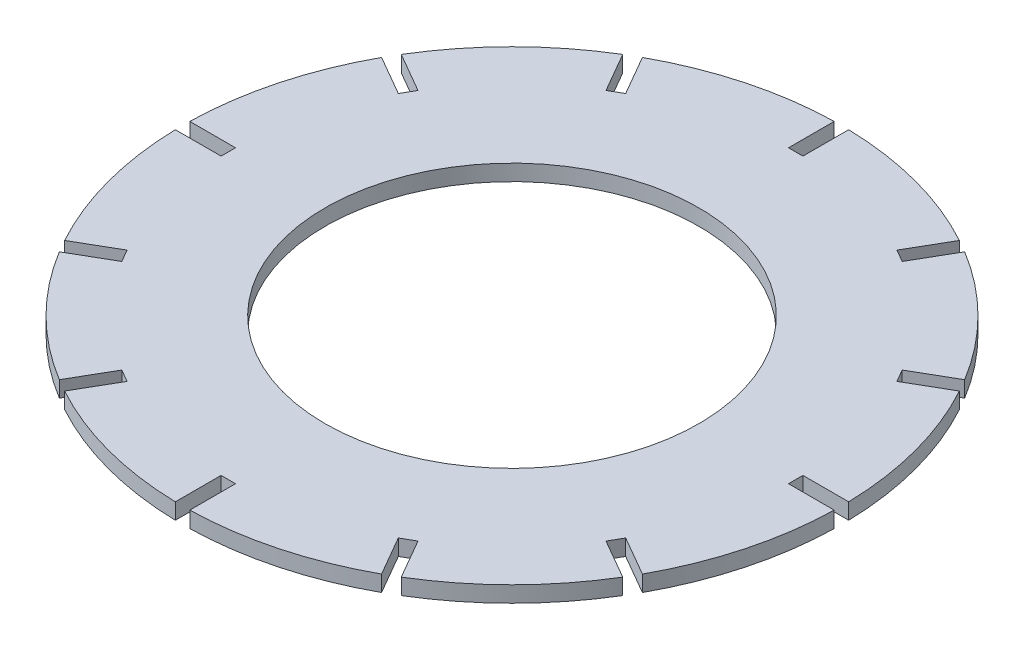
from build123d import *

# Parameters (mm, degrees)
SKETCH1_R           = 35
BOSS_EXTRUDE1_DEPTH = 3


with BuildPart() as part:
    # Sketch1 → Boss-Extrude1 (new body)
    with BuildSketch(Plane(origin=(0, 0, 0), x_dir=(1, 0, 0), z_dir=(0, 1, 0))):
        with BuildLine():
            Line((45.324135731, -27.726747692), (52.737313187, -32.006747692))
            ThreePointArc((52.737313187, -32.006747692), (43.621417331, -43.621417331), (32.006747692, -52.737313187))
            Line((32.006747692, -52.737313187), (27.726747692, -45.324135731))
            Line((27.726747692, -45.324135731), (25.388479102, -46.674135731))
            Line((25.388479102, -46.674135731), (29.668479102, -54.087313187))
            ThreePointArc((29.668479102, -54.087313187), (15.966546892, -59.587964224), (1.35, -61.675226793))
            Line((1.35, -61.675226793), (1.35, -53.115226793))
            Line((1.35, -53.115226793), (-1.35, -53.115226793))
            Line((-1.35, -53.115226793), (-1.35, -61.675226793))
            ThreePointArc((-1.35, -61.675226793), (-15.966546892, -59.587964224), (-29.668479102, -54.087313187))
            Line((-29.668479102, -54.087313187), (-25.388479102, -46.674135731))
            Line((-25.388479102, -46.674135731), (-27.726747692, -45.324135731))
            Line((-27.726747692, -45.324135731), (-32.006747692, -52.737313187))
            ThreePointArc((-32.006747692, -52.737313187), (-43.621417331, -43.621417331), (-52.737313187, -32.006747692))
            Line((-52.737313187, -32.006747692), (-45.324135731, -27.726747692))
            Line((-45.324135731, -27.726747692), (-46.674135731, -25.388479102))
            Line((-46.674135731, -25.388479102), (-54.087313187, -29.668479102))
            ThreePointArc((-54.087313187, -29.668479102), (-59.587964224, -15.966546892), (-61.675226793, -1.35))
            Line((-61.675226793, -1.35), (-53.115226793, -1.35))
            Line((-53.115226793, -1.35), (-53.115226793, 1.35))
            Line((-53.115226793, 1.35), (-61.675226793, 1.35))
            ThreePointArc((-61.675226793, 1.35), (-59.587964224, 15.966546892), (-54.087313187, 29.668479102))
            Line((-54.087313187, 29.668479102), (-46.674135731, 25.388479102))
            Line((-46.674135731, 25.388479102), (-45.324135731, 27.726747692))
            Line((-45.324135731, 27.726747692), (-52.737313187, 32.006747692))
            ThreePointArc((-52.737313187, 32.006747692), (-43.621417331, 43.621417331), (-32.006747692, 52.737313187))
            Line((-32.006747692, 52.737313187), (-27.726747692, 45.324135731))
            Line((-27.726747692, 45.324135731), (-25.388479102, 46.674135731))
            Line((-25.388479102, 46.674135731), (-29.668479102, 54.087313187))
            ThreePointArc((-29.668479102, 54.087313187), (-15.966546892, 59.587964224), (-1.35, 61.675226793))
            Line((-1.35, 61.675226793), (-1.35, 53.115226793))
            Line((-1.35, 53.115226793), (1.35, 53.115226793))
            Line((1.35, 53.115226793), (1.35, 61.675226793))
            ThreePointArc((1.35, 61.675226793), (15.966546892, 59.587964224), (29.668479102, 54.087313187))
            Line((29.668479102, 54.087313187), (25.388479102, 46.674135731))
            Line((25.388479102, 46.674135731), (27.726747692, 45.324135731))
            Line((27.726747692, 45.324135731), (32.006747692, 52.737313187))
            ThreePointArc((32.006747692, 52.737313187), (43.621417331, 43.621417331), (52.737313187, 32.006747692))
            Line((52.737313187, 32.006747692), (45.324135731, 27.726747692))
            Line((45.324135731, 27.726747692), (46.674135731, 25.388479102))
            Line((46.674135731, 25.388479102), (54.087313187, 29.668479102))
            ThreePointArc((54.087313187, 29.668479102), (59.587964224, 15.966546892), (61.675226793, 1.35))
            Line((61.675226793, 1.35), (53.115226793, 1.35))
            Line((53.115226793, 1.35), (53.115226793, -1.35))
            Line((53.115226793, -1.35), (61.675226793, -1.35))
            ThreePointArc((61.675226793, -1.35), (59.587964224, -15.966546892), (54.087313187, -29.668479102))
            Line((54.087313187, -29.668479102), (46.674135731, -25.388479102))
            Line((46.674135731, -25.388479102), (45.324135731, -27.726747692))
        make_face()
        with Locations(Location((0, 0, 0), (0, 0, 270))):
            Circle(SKETCH1_R, mode=Mode.SUBTRACT)
    extrude(amount=BOSS_EXTRUDE1_DEPTH)


solid = part.part
